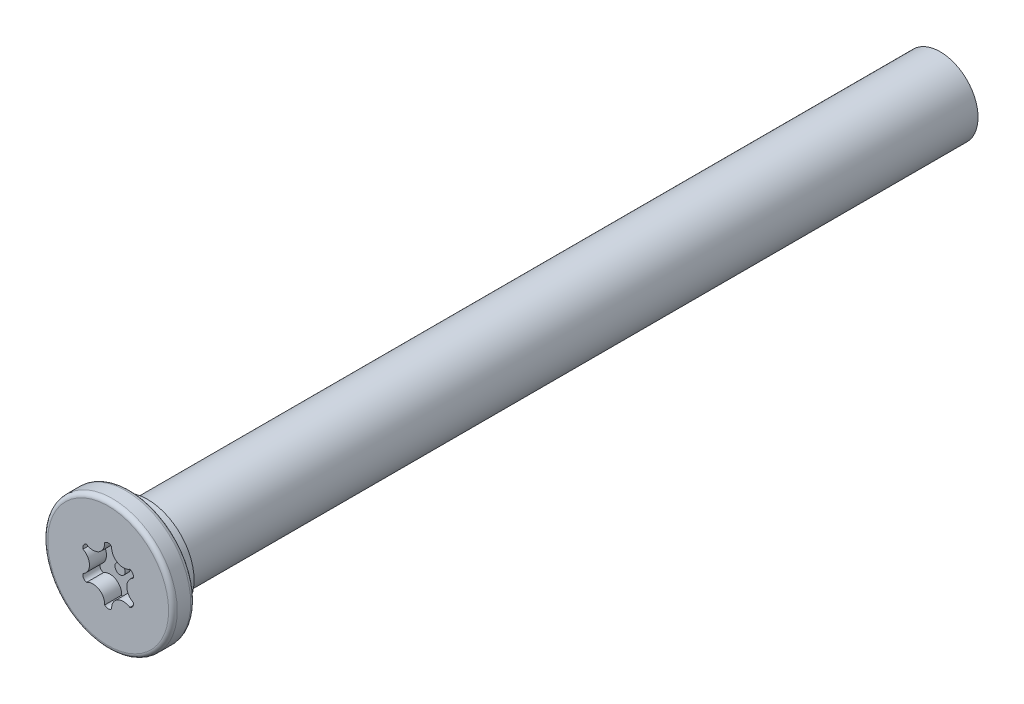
ISO-10303-21;
HEADER;
FILE_DESCRIPTION(('STEP AP214'),'2;1');
FILE_NAME('part.step','',(''),(''),'','','');
FILE_SCHEMA(('AUTOMOTIVE_DESIGN { 1 0 10303 214 1 1 1 1 }'));
ENDSEC;
DATA;
#1=APPLICATION_CONTEXT('core data for automotive mechanical design processes');
#2=APPLICATION_PROTOCOL_DEFINITION('international standard','automotive_design',2000,#1);
#3=PRODUCT_CONTEXT('',#1,'mechanical');
#4=PRODUCT('Part','Part','',(#3));
#5=PRODUCT_RELATED_PRODUCT_CATEGORY('part','',(#4));
#6=PRODUCT_DEFINITION_FORMATION('','',#4);
#7=PRODUCT_DEFINITION_CONTEXT('part definition',#1,'design');
#8=PRODUCT_DEFINITION('design','',#6,#7);
#9=PRODUCT_DEFINITION_SHAPE('','',#8);
#10=(LENGTH_UNIT() NAMED_UNIT(*) SI_UNIT(.MILLI.,.METRE.));
#11=(NAMED_UNIT(*) PLANE_ANGLE_UNIT() SI_UNIT($,.RADIAN.));
#12=(NAMED_UNIT(*) SI_UNIT($,.STERADIAN.) SOLID_ANGLE_UNIT());
#13=UNCERTAINTY_MEASURE_WITH_UNIT(LENGTH_MEASURE(1.E-05),#10,'distance_accuracy_value','');
#14=(GEOMETRIC_REPRESENTATION_CONTEXT(3) GLOBAL_UNCERTAINTY_ASSIGNED_CONTEXT((#13)) GLOBAL_UNIT_ASSIGNED_CONTEXT((#10,
#11,#12)) REPRESENTATION_CONTEXT('',''));
#15=CARTESIAN_POINT('',(0.,0.,0.));
#16=DIRECTION('',(0.,0.,1.));
#17=DIRECTION('',(1.,0.,0.));
#18=AXIS2_PLACEMENT_3D('',#15,#16,#17);
#19=CARTESIAN_POINT('',(0.,0.,0.));
#20=DIRECTION('',(0.,0.,1.));
#21=DIRECTION('',(1.,0.,0.));
#22=AXIS2_PLACEMENT_3D('',#19,#20,#21);
#23=PLANE('',#22);
#24=CARTESIAN_POINT('',(0.,0.,0.));
#25=DIRECTION('',(0.,0.,1.));
#26=DIRECTION('',(1.,0.,0.));
#27=AXIS2_PLACEMENT_3D('',#24,#25,#26);
#28=CIRCLE('',#27,3.55599999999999);
#29=CARTESIAN_POINT('',(3.55599999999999,0.,0.));
#30=VERTEX_POINT('',#29);
#31=EDGE_CURVE('E54',#30,#30,#28,.T.);
#32=ORIENTED_EDGE('',*,*,#31,.T.);
#33=EDGE_LOOP('',(#32));
#34=FACE_BOUND('',#33,.T.);
#35=CARTESIAN_POINT('',(0.893828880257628,1.54815703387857,0.));
#36=DIRECTION('',(0.,0.,1.));
#37=DIRECTION('',(1.,0.,0.));
#38=AXIS2_PLACEMENT_3D('',#35,#36,#37);
#39=CIRCLE('',#38,0.69);
#40=CARTESIAN_POINT('',(0.205060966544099,1.58937306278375,0.));
#41=VERTEX_POINT('',#40);
#42=CARTESIAN_POINT('',(1.27390696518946,0.972274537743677,0.));
#43=VERTEX_POINT('',#42);
#44=EDGE_CURVE('E181',#41,#43,#39,.T.);
#45=ORIENTED_EDGE('',*,*,#44,.T.);
#46=CARTESIAN_POINT('',(1.19884944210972,0.692156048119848,0.));
#47=DIRECTION('',(0.,0.,1.));
#48=DIRECTION('',(1.,0.,0.));
#49=AXIS2_PLACEMENT_3D('',#46,#47,#48);
#50=CIRCLE('',#49,0.29);
#51=CARTESIAN_POINT('',(1.47896793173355,0.617098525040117,0.));
#52=VERTEX_POINT('',#51);
#53=EDGE_CURVE('E61',#43,#52,#50,.F.);
#54=ORIENTED_EDGE('',*,*,#53,.T.);
#55=CARTESIAN_POINT('',(1.78765776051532,0.,0.));
#56=DIRECTION('',(0.,0.,1.));
#57=DIRECTION('',(1.,0.,0.));
#58=AXIS2_PLACEMENT_3D('',#55,#56,#57);
#59=CIRCLE('',#58,0.69);
#60=CARTESIAN_POINT('',(1.47896793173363,-0.617098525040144,0.));
#61=VERTEX_POINT('',#60);
#62=EDGE_CURVE('E111',#52,#61,#59,.T.);
#63=ORIENTED_EDGE('',*,*,#62,.T.);
#64=CARTESIAN_POINT('',(1.1988494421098,-0.692156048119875,0.));
#65=DIRECTION('',(0.,0.,1.));
#66=DIRECTION('',(1.,0.,0.));
#67=AXIS2_PLACEMENT_3D('',#64,#65,#66);
#68=CIRCLE('',#67,0.29);
#69=CARTESIAN_POINT('',(1.27390696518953,-0.972274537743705,0.));
#70=VERTEX_POINT('',#69);
#71=EDGE_CURVE('E216',#61,#70,#68,.F.);
#72=ORIENTED_EDGE('',*,*,#71,.T.);
#73=CARTESIAN_POINT('',(0.893828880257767,-1.54815703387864,0.));
#74=DIRECTION('',(0.,0.,1.));
#75=DIRECTION('',(1.,0.,0.));
#76=AXIS2_PLACEMENT_3D('',#73,#74,#75);
#77=CIRCLE('',#76,0.69);
#78=CARTESIAN_POINT('',(0.205060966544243,-1.5893730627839,0.));
#79=VERTEX_POINT('',#78);
#80=EDGE_CURVE('E160',#70,#79,#77,.T.);
#81=ORIENTED_EDGE('',*,*,#80,.T.);
#82=CARTESIAN_POINT('',(1.43067375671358E-13,-1.3843120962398,0.));
#83=DIRECTION('',(0.,0.,1.));
#84=DIRECTION('',(1.,0.,0.));
#85=AXIS2_PLACEMENT_3D('',#82,#83,#84);
#86=CIRCLE('',#85,0.29);
#87=CARTESIAN_POINT('',(-0.205060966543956,-1.5893730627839,0.));
#88=VERTEX_POINT('',#87);
#89=EDGE_CURVE('E210',#79,#88,#86,.F.);
#90=ORIENTED_EDGE('',*,*,#89,.T.);
#91=CARTESIAN_POINT('',(-0.893828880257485,-1.54815703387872,0.));
#92=DIRECTION('',(0.,0.,1.));
#93=DIRECTION('',(1.,0.,0.));
#94=AXIS2_PLACEMENT_3D('',#91,#92,#93);
#95=CIRCLE('',#94,0.69);
#96=CARTESIAN_POINT('',(-1.27390696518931,-0.97227453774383,0.));
#97=VERTEX_POINT('',#96);
#98=EDGE_CURVE('E206',#88,#97,#95,.T.);
#99=ORIENTED_EDGE('',*,*,#98,.T.);
#100=CARTESIAN_POINT('',(-1.19884944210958,-0.69215604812,0.));
#101=DIRECTION('',(0.,0.,1.));
#102=DIRECTION('',(1.,0.,0.));
#103=AXIS2_PLACEMENT_3D('',#100,#101,#102);
#104=CIRCLE('',#103,0.29);
#105=CARTESIAN_POINT('',(-1.47896793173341,-0.617098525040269,0.));
#106=VERTEX_POINT('',#105);
#107=EDGE_CURVE('E202',#97,#106,#104,.F.);
#108=ORIENTED_EDGE('',*,*,#107,.T.);
#109=CARTESIAN_POINT('',(-1.78765776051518,-1.56674837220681E-13,0.));
#110=DIRECTION('',(0.,0.,1.));
#111=DIRECTION('',(1.,0.,0.));
#112=AXIS2_PLACEMENT_3D('',#109,#110,#111);
#113=CIRCLE('',#112,0.69);
#114=CARTESIAN_POINT('',(-1.47896793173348,0.617098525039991,0.));
#115=VERTEX_POINT('',#114);
#116=EDGE_CURVE('E198',#106,#115,#113,.T.);
#117=ORIENTED_EDGE('',*,*,#116,.T.);
#118=CARTESIAN_POINT('',(-1.19884944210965,0.692156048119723,0.));
#119=DIRECTION('',(0.,0.,1.));
#120=DIRECTION('',(1.,0.,0.));
#121=AXIS2_PLACEMENT_3D('',#118,#119,#120);
#122=CIRCLE('',#121,0.29);
#123=CARTESIAN_POINT('',(-1.27390696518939,0.972274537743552,0.));
#124=VERTEX_POINT('',#123);
#125=EDGE_CURVE('E194',#115,#124,#122,.F.);
#126=ORIENTED_EDGE('',*,*,#125,.T.);
#127=CARTESIAN_POINT('',(-0.893828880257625,1.54815703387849,0.));
#128=DIRECTION('',(0.,0.,1.));
#129=DIRECTION('',(1.,0.,0.));
#130=AXIS2_PLACEMENT_3D('',#127,#128,#129);
#131=CIRCLE('',#130,0.690000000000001);
#132=CARTESIAN_POINT('',(-0.205060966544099,1.58937306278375,0.));
#133=VERTEX_POINT('',#132);
#134=EDGE_CURVE('E190',#124,#133,#131,.T.);
#135=ORIENTED_EDGE('',*,*,#134,.T.);
#136=CARTESIAN_POINT('',(0.,1.38431209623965,0.));
#137=DIRECTION('',(0.,0.,1.));
#138=DIRECTION('',(1.,0.,0.));
#139=AXIS2_PLACEMENT_3D('',#136,#137,#138);
#140=CIRCLE('',#139,0.29);
#141=EDGE_CURVE('E186',#133,#41,#140,.F.);
#142=ORIENTED_EDGE('',*,*,#141,.T.);
#143=EDGE_LOOP('',(#45,#54,#63,#72,#81,#90,#99,#108,#117,#126,#135,#142));
#144=FACE_BOUND('',#143,.T.);
#145=ADVANCED_FACE('F45',(#34,#144),#23,.T.);
#146=CARTESIAN_POINT('',(0.,0.,-1.3));
#147=DIRECTION('',(0.,0.,1.));
#148=DIRECTION('',(1.,0.,0.));
#149=AXIS2_PLACEMENT_3D('',#146,#147,#148);
#150=PLANE('',#149);
#151=CARTESIAN_POINT('',(0.,0.,-1.3));
#152=DIRECTION('',(0.,0.,1.));
#153=DIRECTION('',(1.,0.,0.));
#154=AXIS2_PLACEMENT_3D('',#151,#152,#153);
#155=CIRCLE('',#154,2.738000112);
#156=CARTESIAN_POINT('',(2.738000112,0.,-1.3));
#157=VERTEX_POINT('',#156);
#158=EDGE_CURVE('E11',#157,#157,#155,.F.);
#159=ORIENTED_EDGE('',*,*,#158,.F.);
#160=EDGE_LOOP('',(#159));
#161=FACE_BOUND('',#160,.T.);
#162=CARTESIAN_POINT('',(0.,0.,-1.3));
#163=DIRECTION('',(0.,0.,1.));
#164=DIRECTION('',(1.,0.,0.));
#165=AXIS2_PLACEMENT_3D('',#162,#163,#164);
#166=CIRCLE('',#165,3.55599999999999);
#167=CARTESIAN_POINT('',(3.55599999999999,0.,-1.3));
#168=VERTEX_POINT('',#167);
#169=EDGE_CURVE('E260',#168,#168,#166,.F.);
#170=ORIENTED_EDGE('',*,*,#169,.T.);
#171=EDGE_LOOP('',(#170));
#172=FACE_BOUND('',#171,.T.);
#173=ADVANCED_FACE('F283',(#161,#172),#150,.F.);
#174=CARTESIAN_POINT('',(0.,0.,-1.3));
#175=DIRECTION('',(0.,0.,1.));
#176=DIRECTION('',(1.,0.,0.));
#177=AXIS2_PLACEMENT_3D('',#174,#175,#176);
#178=CYLINDRICAL_SURFACE('',#177,3.80999999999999);
#179=CARTESIAN_POINT('',(0.,0.,-1.046));
#180=DIRECTION('',(0.,0.,1.));
#181=DIRECTION('',(1.,0.,0.));
#182=AXIS2_PLACEMENT_3D('',#179,#180,#181);
#183=CIRCLE('',#182,3.80999999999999);
#184=CARTESIAN_POINT('',(3.80999999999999,0.,-1.046));
#185=VERTEX_POINT('',#184);
#186=EDGE_CURVE('E256',#185,#185,#183,.T.);
#187=ORIENTED_EDGE('',*,*,#186,.T.);
#188=EDGE_LOOP('',(#187));
#189=FACE_BOUND('',#188,.T.);
#190=CARTESIAN_POINT('',(0.,0.,-0.254));
#191=DIRECTION('',(0.,0.,1.));
#192=DIRECTION('',(1.,0.,0.));
#193=AXIS2_PLACEMENT_3D('',#190,#191,#192);
#194=CIRCLE('',#193,3.80999999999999);
#195=CARTESIAN_POINT('',(3.80999999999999,0.,-0.254));
#196=VERTEX_POINT('',#195);
#197=EDGE_CURVE('E225',#196,#196,#194,.F.);
#198=ORIENTED_EDGE('',*,*,#197,.T.);
#199=EDGE_LOOP('',(#198));
#200=FACE_BOUND('',#199,.T.);
#201=ADVANCED_FACE('F289',(#189,#200),#178,.T.);
#202=CARTESIAN_POINT('',(1.19884944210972,0.692156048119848,-1.));
#203=DIRECTION('',(0.,0.,1.));
#204=DIRECTION('',(1.,0.,0.));
#205=AXIS2_PLACEMENT_3D('',#202,#203,#204);
#206=CYLINDRICAL_SURFACE('',#205,0.29);
#207=ORIENTED_EDGE('',*,*,#53,.F.);
#208=DIRECTION('',(0.,0.,1.));
#209=VECTOR('',#208,1.);
#210=CARTESIAN_POINT('',(1.27390696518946,0.972274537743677,-1.));
#211=LINE('',#210,#209);
#212=CARTESIAN_POINT('',(1.27390696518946,0.972274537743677,-1.));
#213=VERTEX_POINT('',#212);
#214=EDGE_CURVE('E178',#213,#43,#211,.T.);
#215=ORIENTED_EDGE('',*,*,#214,.F.);
#216=CARTESIAN_POINT('',(1.19884944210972,0.692156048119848,-1.));
#217=DIRECTION('',(0.,0.,1.));
#218=DIRECTION('',(1.,0.,0.));
#219=AXIS2_PLACEMENT_3D('',#216,#217,#218);
#220=CIRCLE('',#219,0.29);
#221=CARTESIAN_POINT('',(1.47896793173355,0.617098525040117,-1.));
#222=VERTEX_POINT('',#221);
#223=EDGE_CURVE('E221',#213,#222,#220,.F.);
#224=ORIENTED_EDGE('',*,*,#223,.T.);
#225=DIRECTION('',(0.,0.,1.));
#226=VECTOR('',#225,1.);
#227=CARTESIAN_POINT('',(1.47896793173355,0.617098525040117,-1.));
#228=LINE('',#227,#226);
#229=EDGE_CURVE('E222',#222,#52,#228,.T.);
#230=ORIENTED_EDGE('',*,*,#229,.T.);
#231=EDGE_LOOP('',(#207,#215,#224,#230));
#232=FACE_BOUND('',#231,.T.);
#233=ADVANCED_FACE('F294',(#232),#206,.F.);
#234=CARTESIAN_POINT('',(1.78765776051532,0.,-1.));
#235=DIRECTION('',(0.,0.,1.));
#236=DIRECTION('',(1.,0.,0.));
#237=AXIS2_PLACEMENT_3D('',#234,#235,#236);
#238=CYLINDRICAL_SURFACE('',#237,0.69);
#239=ORIENTED_EDGE('',*,*,#62,.F.);
#240=ORIENTED_EDGE('',*,*,#229,.F.);
#241=CARTESIAN_POINT('',(1.78765776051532,0.,-1.));
#242=DIRECTION('',(0.,0.,1.));
#243=DIRECTION('',(1.,0.,0.));
#244=AXIS2_PLACEMENT_3D('',#241,#242,#243);
#245=CIRCLE('',#244,0.69);
#246=CARTESIAN_POINT('',(1.47896793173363,-0.617098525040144,-1.));
#247=VERTEX_POINT('',#246);
#248=EDGE_CURVE('E70',#222,#247,#245,.T.);
#249=ORIENTED_EDGE('',*,*,#248,.T.);
#250=DIRECTION('',(0.,0.,1.));
#251=VECTOR('',#250,1.);
#252=CARTESIAN_POINT('',(1.47896793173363,-0.617098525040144,-1.));
#253=LINE('',#252,#251);
#254=EDGE_CURVE('E151',#247,#61,#253,.T.);
#255=ORIENTED_EDGE('',*,*,#254,.T.);
#256=EDGE_LOOP('',(#239,#240,#249,#255));
#257=FACE_BOUND('',#256,.T.);
#258=ADVANCED_FACE('F301',(#257),#238,.T.);
#259=CARTESIAN_POINT('',(1.1988494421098,-0.692156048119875,-1.));
#260=DIRECTION('',(0.,0.,1.));
#261=DIRECTION('',(1.,0.,0.));
#262=AXIS2_PLACEMENT_3D('',#259,#260,#261);
#263=CYLINDRICAL_SURFACE('',#262,0.29);
#264=ORIENTED_EDGE('',*,*,#71,.F.);
#265=ORIENTED_EDGE('',*,*,#254,.F.);
#266=CARTESIAN_POINT('',(1.1988494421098,-0.692156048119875,-1.));
#267=DIRECTION('',(0.,0.,1.));
#268=DIRECTION('',(1.,0.,0.));
#269=AXIS2_PLACEMENT_3D('',#266,#267,#268);
#270=CIRCLE('',#269,0.29);
#271=CARTESIAN_POINT('',(1.27390696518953,-0.972274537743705,-1.));
#272=VERTEX_POINT('',#271);
#273=EDGE_CURVE('E145',#247,#272,#270,.F.);
#274=ORIENTED_EDGE('',*,*,#273,.T.);
#275=DIRECTION('',(0.,0.,1.));
#276=VECTOR('',#275,1.);
#277=CARTESIAN_POINT('',(1.27390696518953,-0.972274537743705,-1.));
#278=LINE('',#277,#276);
#279=EDGE_CURVE('E149',#272,#70,#278,.T.);
#280=ORIENTED_EDGE('',*,*,#279,.T.);
#281=EDGE_LOOP('',(#264,#265,#274,#280));
#282=FACE_BOUND('',#281,.T.);
#283=ADVANCED_FACE('F148',(#282),#263,.F.);
#284=CARTESIAN_POINT('',(0.893828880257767,-1.54815703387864,-1.));
#285=DIRECTION('',(0.,0.,1.));
#286=DIRECTION('',(1.,0.,0.));
#287=AXIS2_PLACEMENT_3D('',#284,#285,#286);
#288=CYLINDRICAL_SURFACE('',#287,0.69);
#289=ORIENTED_EDGE('',*,*,#80,.F.);
#290=ORIENTED_EDGE('',*,*,#279,.F.);
#291=CARTESIAN_POINT('',(0.893828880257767,-1.54815703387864,-1.));
#292=DIRECTION('',(0.,0.,1.));
#293=DIRECTION('',(1.,0.,0.));
#294=AXIS2_PLACEMENT_3D('',#291,#292,#293);
#295=CIRCLE('',#294,0.69);
#296=CARTESIAN_POINT('',(0.205060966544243,-1.5893730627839,-1.));
#297=VERTEX_POINT('',#296);
#298=EDGE_CURVE('E154',#272,#297,#295,.T.);
#299=ORIENTED_EDGE('',*,*,#298,.T.);
#300=DIRECTION('',(0.,0.,1.));
#301=VECTOR('',#300,1.);
#302=CARTESIAN_POINT('',(0.205060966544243,-1.5893730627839,-1.));
#303=LINE('',#302,#301);
#304=EDGE_CURVE('E163',#297,#79,#303,.T.);
#305=ORIENTED_EDGE('',*,*,#304,.T.);
#306=EDGE_LOOP('',(#289,#290,#299,#305));
#307=FACE_BOUND('',#306,.T.);
#308=ADVANCED_FACE('F157',(#307),#288,.T.);
#309=CARTESIAN_POINT('',(1.43067375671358E-13,-1.3843120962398,-1.));
#310=DIRECTION('',(0.,0.,1.));
#311=DIRECTION('',(1.,0.,0.));
#312=AXIS2_PLACEMENT_3D('',#309,#310,#311);
#313=CYLINDRICAL_SURFACE('',#312,0.29);
#314=ORIENTED_EDGE('',*,*,#89,.F.);
#315=ORIENTED_EDGE('',*,*,#304,.F.);
#316=CARTESIAN_POINT('',(1.43067375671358E-13,-1.3843120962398,-1.));
#317=DIRECTION('',(0.,0.,1.));
#318=DIRECTION('',(1.,0.,0.));
#319=AXIS2_PLACEMENT_3D('',#316,#317,#318);
#320=CIRCLE('',#319,0.29);
#321=CARTESIAN_POINT('',(-0.205060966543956,-1.5893730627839,-1.));
#322=VERTEX_POINT('',#321);
#323=EDGE_CURVE('E168',#297,#322,#320,.F.);
#324=ORIENTED_EDGE('',*,*,#323,.T.);
#325=DIRECTION('',(0.,0.,1.));
#326=VECTOR('',#325,1.);
#327=CARTESIAN_POINT('',(-0.205060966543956,-1.5893730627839,-1.));
#328=LINE('',#327,#326);
#329=EDGE_CURVE('E230',#322,#88,#328,.T.);
#330=ORIENTED_EDGE('',*,*,#329,.T.);
#331=EDGE_LOOP('',(#314,#315,#324,#330));
#332=FACE_BOUND('',#331,.T.);
#333=ADVANCED_FACE('F318',(#332),#313,.F.);
#334=CARTESIAN_POINT('',(-0.893828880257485,-1.54815703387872,-1.));
#335=DIRECTION('',(0.,0.,1.));
#336=DIRECTION('',(1.,0.,0.));
#337=AXIS2_PLACEMENT_3D('',#334,#335,#336);
#338=CYLINDRICAL_SURFACE('',#337,0.69);
#339=ORIENTED_EDGE('',*,*,#98,.F.);
#340=ORIENTED_EDGE('',*,*,#329,.F.);
#341=CARTESIAN_POINT('',(-0.893828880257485,-1.54815703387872,-1.));
#342=DIRECTION('',(0.,0.,1.));
#343=DIRECTION('',(1.,0.,0.));
#344=AXIS2_PLACEMENT_3D('',#341,#342,#343);
#345=CIRCLE('',#344,0.69);
#346=CARTESIAN_POINT('',(-1.27390696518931,-0.97227453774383,-1.));
#347=VERTEX_POINT('',#346);
#348=EDGE_CURVE('E172',#322,#347,#345,.T.);
#349=ORIENTED_EDGE('',*,*,#348,.T.);
#350=DIRECTION('',(0.,0.,1.));
#351=VECTOR('',#350,1.);
#352=CARTESIAN_POINT('',(-1.27390696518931,-0.97227453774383,-1.));
#353=LINE('',#352,#351);
#354=EDGE_CURVE('E233',#347,#97,#353,.T.);
#355=ORIENTED_EDGE('',*,*,#354,.T.);
#356=EDGE_LOOP('',(#339,#340,#349,#355));
#357=FACE_BOUND('',#356,.T.);
#358=ADVANCED_FACE('F321',(#357),#338,.T.);
#359=CARTESIAN_POINT('',(-1.19884944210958,-0.69215604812,-1.));
#360=DIRECTION('',(0.,0.,1.));
#361=DIRECTION('',(1.,0.,0.));
#362=AXIS2_PLACEMENT_3D('',#359,#360,#361);
#363=CYLINDRICAL_SURFACE('',#362,0.29);
#364=ORIENTED_EDGE('',*,*,#107,.F.);
#365=ORIENTED_EDGE('',*,*,#354,.F.);
#366=CARTESIAN_POINT('',(-1.19884944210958,-0.69215604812,-1.));
#367=DIRECTION('',(0.,0.,1.));
#368=DIRECTION('',(1.,0.,0.));
#369=AXIS2_PLACEMENT_3D('',#366,#367,#368);
#370=CIRCLE('',#369,0.29);
#371=CARTESIAN_POINT('',(-1.47896793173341,-0.617098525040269,-1.));
#372=VERTEX_POINT('',#371);
#373=EDGE_CURVE('E374',#347,#372,#370,.F.);
#374=ORIENTED_EDGE('',*,*,#373,.T.);
#375=DIRECTION('',(0.,0.,1.));
#376=VECTOR('',#375,1.);
#377=CARTESIAN_POINT('',(-1.47896793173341,-0.617098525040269,-1.));
#378=LINE('',#377,#376);
#379=EDGE_CURVE('E236',#372,#106,#378,.T.);
#380=ORIENTED_EDGE('',*,*,#379,.T.);
#381=EDGE_LOOP('',(#364,#365,#374,#380));
#382=FACE_BOUND('',#381,.T.);
#383=ADVANCED_FACE('F325',(#382),#363,.F.);
#384=CARTESIAN_POINT('',(-1.78765776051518,-1.56674837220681E-13,-1.));
#385=DIRECTION('',(0.,0.,1.));
#386=DIRECTION('',(1.,0.,0.));
#387=AXIS2_PLACEMENT_3D('',#384,#385,#386);
#388=CYLINDRICAL_SURFACE('',#387,0.69);
#389=ORIENTED_EDGE('',*,*,#116,.F.);
#390=ORIENTED_EDGE('',*,*,#379,.F.);
#391=CARTESIAN_POINT('',(-1.78765776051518,-1.56674837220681E-13,-1.));
#392=DIRECTION('',(0.,0.,1.));
#393=DIRECTION('',(1.,0.,0.));
#394=AXIS2_PLACEMENT_3D('',#391,#392,#393);
#395=CIRCLE('',#394,0.69);
#396=CARTESIAN_POINT('',(-1.47896793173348,0.617098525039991,-1.));
#397=VERTEX_POINT('',#396);
#398=EDGE_CURVE('E371',#372,#397,#395,.T.);
#399=ORIENTED_EDGE('',*,*,#398,.T.);
#400=DIRECTION('',(0.,0.,1.));
#401=VECTOR('',#400,1.);
#402=CARTESIAN_POINT('',(-1.47896793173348,0.617098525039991,-1.));
#403=LINE('',#402,#401);
#404=EDGE_CURVE('E239',#397,#115,#403,.T.);
#405=ORIENTED_EDGE('',*,*,#404,.T.);
#406=EDGE_LOOP('',(#389,#390,#399,#405));
#407=FACE_BOUND('',#406,.T.);
#408=ADVANCED_FACE('F329',(#407),#388,.T.);
#409=CARTESIAN_POINT('',(-1.19884944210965,0.692156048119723,-1.));
#410=DIRECTION('',(0.,0.,1.));
#411=DIRECTION('',(1.,0.,0.));
#412=AXIS2_PLACEMENT_3D('',#409,#410,#411);
#413=CYLINDRICAL_SURFACE('',#412,0.29);
#414=ORIENTED_EDGE('',*,*,#125,.F.);
#415=ORIENTED_EDGE('',*,*,#404,.F.);
#416=CARTESIAN_POINT('',(-1.19884944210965,0.692156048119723,-1.));
#417=DIRECTION('',(0.,0.,1.));
#418=DIRECTION('',(1.,0.,0.));
#419=AXIS2_PLACEMENT_3D('',#416,#417,#418);
#420=CIRCLE('',#419,0.29);
#421=CARTESIAN_POINT('',(-1.27390696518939,0.972274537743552,-1.));
#422=VERTEX_POINT('',#421);
#423=EDGE_CURVE('E364',#397,#422,#420,.F.);
#424=ORIENTED_EDGE('',*,*,#423,.T.);
#425=DIRECTION('',(0.,0.,1.));
#426=VECTOR('',#425,1.);
#427=CARTESIAN_POINT('',(-1.27390696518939,0.972274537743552,-1.));
#428=LINE('',#427,#426);
#429=EDGE_CURVE('E242',#422,#124,#428,.T.);
#430=ORIENTED_EDGE('',*,*,#429,.T.);
#431=EDGE_LOOP('',(#414,#415,#424,#430));
#432=FACE_BOUND('',#431,.T.);
#433=ADVANCED_FACE('F333',(#432),#413,.F.);
#434=CARTESIAN_POINT('',(-0.893828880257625,1.54815703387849,-1.));
#435=DIRECTION('',(0.,0.,1.));
#436=DIRECTION('',(1.,0.,0.));
#437=AXIS2_PLACEMENT_3D('',#434,#435,#436);
#438=CYLINDRICAL_SURFACE('',#437,0.690000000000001);
#439=ORIENTED_EDGE('',*,*,#134,.F.);
#440=ORIENTED_EDGE('',*,*,#429,.F.);
#441=CARTESIAN_POINT('',(-0.893828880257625,1.54815703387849,-1.));
#442=DIRECTION('',(0.,0.,1.));
#443=DIRECTION('',(1.,0.,0.));
#444=AXIS2_PLACEMENT_3D('',#441,#442,#443);
#445=CIRCLE('',#444,0.690000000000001);
#446=CARTESIAN_POINT('',(-0.205060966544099,1.58937306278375,-1.));
#447=VERTEX_POINT('',#446);
#448=EDGE_CURVE('E360',#422,#447,#445,.T.);
#449=ORIENTED_EDGE('',*,*,#448,.T.);
#450=DIRECTION('',(0.,0.,1.));
#451=VECTOR('',#450,1.);
#452=CARTESIAN_POINT('',(-0.205060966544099,1.58937306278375,-1.));
#453=LINE('',#452,#451);
#454=EDGE_CURVE('E245',#447,#133,#453,.T.);
#455=ORIENTED_EDGE('',*,*,#454,.T.);
#456=EDGE_LOOP('',(#439,#440,#449,#455));
#457=FACE_BOUND('',#456,.T.);
#458=ADVANCED_FACE('F337',(#457),#438,.T.);
#459=CARTESIAN_POINT('',(0.,1.38431209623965,-1.));
#460=DIRECTION('',(0.,0.,1.));
#461=DIRECTION('',(1.,0.,0.));
#462=AXIS2_PLACEMENT_3D('',#459,#460,#461);
#463=CYLINDRICAL_SURFACE('',#462,0.29);
#464=ORIENTED_EDGE('',*,*,#141,.F.);
#465=ORIENTED_EDGE('',*,*,#454,.F.);
#466=CARTESIAN_POINT('',(0.,1.38431209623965,-1.));
#467=DIRECTION('',(0.,0.,1.));
#468=DIRECTION('',(1.,0.,0.));
#469=AXIS2_PLACEMENT_3D('',#466,#467,#468);
#470=CIRCLE('',#469,0.29);
#471=CARTESIAN_POINT('',(0.205060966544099,1.58937306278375,-1.));
#472=VERTEX_POINT('',#471);
#473=EDGE_CURVE('E357',#447,#472,#470,.F.);
#474=ORIENTED_EDGE('',*,*,#473,.T.);
#475=DIRECTION('',(0.,0.,1.));
#476=VECTOR('',#475,1.);
#477=CARTESIAN_POINT('',(0.205060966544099,1.58937306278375,-1.));
#478=LINE('',#477,#476);
#479=EDGE_CURVE('E248',#472,#41,#478,.T.);
#480=ORIENTED_EDGE('',*,*,#479,.T.);
#481=EDGE_LOOP('',(#464,#465,#474,#480));
#482=FACE_BOUND('',#481,.T.);
#483=ADVANCED_FACE('F341',(#482),#463,.F.);
#484=CARTESIAN_POINT('',(0.893828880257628,1.54815703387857,-1.));
#485=DIRECTION('',(0.,0.,1.));
#486=DIRECTION('',(1.,0.,0.));
#487=AXIS2_PLACEMENT_3D('',#484,#485,#486);
#488=CYLINDRICAL_SURFACE('',#487,0.69);
#489=ORIENTED_EDGE('',*,*,#44,.F.);
#490=ORIENTED_EDGE('',*,*,#479,.F.);
#491=CARTESIAN_POINT('',(0.893828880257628,1.54815703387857,-1.));
#492=DIRECTION('',(0.,0.,1.));
#493=DIRECTION('',(1.,0.,0.));
#494=AXIS2_PLACEMENT_3D('',#491,#492,#493);
#495=CIRCLE('',#494,0.69);
#496=EDGE_CURVE('E118',#472,#213,#495,.T.);
#497=ORIENTED_EDGE('',*,*,#496,.T.);
#498=ORIENTED_EDGE('',*,*,#214,.T.);
#499=EDGE_LOOP('',(#489,#490,#497,#498));
#500=FACE_BOUND('',#499,.T.);
#501=ADVANCED_FACE('F344',(#500),#488,.T.);
#502=CARTESIAN_POINT('',(0.,0.,-1.));
#503=DIRECTION('',(0.,0.,1.));
#504=DIRECTION('',(1.,0.,0.));
#505=AXIS2_PLACEMENT_3D('',#502,#503,#504);
#506=PLANE('',#505);
#507=CARTESIAN_POINT('',(0.,0.,-1.));
#508=DIRECTION('',(0.,0.,1.));
#509=DIRECTION('',(1.,0.,0.));
#510=AXIS2_PLACEMENT_3D('',#507,#508,#509);
#511=CIRCLE('',#510,0.3);
#512=CARTESIAN_POINT('',(0.3,0.,-1.));
#513=VERTEX_POINT('',#512);
#514=EDGE_CURVE('E396',#513,#513,#511,.T.);
#515=ORIENTED_EDGE('',*,*,#514,.F.);
#516=EDGE_LOOP('',(#515));
#517=FACE_BOUND('',#516,.T.);
#518=ORIENTED_EDGE('',*,*,#223,.F.);
#519=ORIENTED_EDGE('',*,*,#496,.F.);
#520=ORIENTED_EDGE('',*,*,#473,.F.);
#521=ORIENTED_EDGE('',*,*,#448,.F.);
#522=ORIENTED_EDGE('',*,*,#423,.F.);
#523=ORIENTED_EDGE('',*,*,#398,.F.);
#524=ORIENTED_EDGE('',*,*,#373,.F.);
#525=ORIENTED_EDGE('',*,*,#348,.F.);
#526=ORIENTED_EDGE('',*,*,#323,.F.);
#527=ORIENTED_EDGE('',*,*,#298,.F.);
#528=ORIENTED_EDGE('',*,*,#273,.F.);
#529=ORIENTED_EDGE('',*,*,#248,.F.);
#530=EDGE_LOOP('',(#518,#519,#520,#521,#522,#523,#524,#525,#526,#527,#528,#529));
#531=FACE_BOUND('',#530,.T.);
#532=ADVANCED_FACE('F166',(#517,#531),#506,.T.);
#533=CARTESIAN_POINT('',(0.,0.,-1.046));
#534=DIRECTION('',(0.,0.,1.));
#535=DIRECTION('',(1.,0.,0.));
#536=AXIS2_PLACEMENT_3D('',#533,#534,#535);
#537=TOROIDAL_SURFACE('',#536,3.55599999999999,0.254);
#538=ORIENTED_EDGE('',*,*,#169,.F.);
#539=EDGE_LOOP('',(#538));
#540=FACE_BOUND('',#539,.T.);
#541=ORIENTED_EDGE('',*,*,#186,.F.);
#542=EDGE_LOOP('',(#541));
#543=FACE_BOUND('',#542,.T.);
#544=ADVANCED_FACE('F271',(#540,#543),#537,.T.);
#545=CARTESIAN_POINT('',(0.,0.,-0.254));
#546=DIRECTION('',(0.,0.,1.));
#547=DIRECTION('',(1.,0.,0.));
#548=AXIS2_PLACEMENT_3D('',#545,#546,#547);
#549=TOROIDAL_SURFACE('',#548,3.55599999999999,0.254);
#550=ORIENTED_EDGE('',*,*,#197,.F.);
#551=EDGE_LOOP('',(#550));
#552=FACE_BOUND('',#551,.T.);
#553=ORIENTED_EDGE('',*,*,#31,.F.);
#554=EDGE_LOOP('',(#553));
#555=FACE_BOUND('',#554,.T.);
#556=ADVANCED_FACE('F47',(#552,#555),#549,.T.);
#557=CARTESIAN_POINT('',(0.,0.,-2.316));
#558=DIRECTION('',(0.,0.,-1.));
#559=DIRECTION('',(-1.,0.,0.));
#560=AXIS2_PLACEMENT_3D('',#557,#558,#559);
#561=PLANE('',#560);
#562=CARTESIAN_POINT('',(0.,0.,-2.316));
#563=DIRECTION('',(0.,0.,-1.));
#564=DIRECTION('',(-1.,0.,0.));
#565=AXIS2_PLACEMENT_3D('',#562,#563,#564);
#566=CIRCLE('',#565,2.738000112);
#567=CARTESIAN_POINT('',(-2.738000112,0.,-2.316));
#568=VERTEX_POINT('',#567);
#569=EDGE_CURVE('E182',#568,#568,#566,.T.);
#570=ORIENTED_EDGE('',*,*,#569,.T.);
#571=EDGE_LOOP('',(#570));
#572=FACE_BOUND('',#571,.T.);
#573=CARTESIAN_POINT('',(0.,0.,-2.316));
#574=DIRECTION('',(0.,0.,-1.));
#575=DIRECTION('',(-1.,0.,0.));
#576=AXIS2_PLACEMENT_3D('',#573,#574,#575);
#577=CIRCLE('',#576,2.230000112);
#578=CARTESIAN_POINT('',(-2.230000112,0.,-2.316));
#579=VERTEX_POINT('',#578);
#580=EDGE_CURVE('E400',#579,#579,#577,.T.);
#581=ORIENTED_EDGE('',*,*,#580,.F.);
#582=EDGE_LOOP('',(#581));
#583=FACE_BOUND('',#582,.T.);
#584=ADVANCED_FACE('F270',(#572,#583),#561,.T.);
#585=CARTESIAN_POINT('',(0.,0.,-2.316));
#586=DIRECTION('',(0.,0.,1.));
#587=DIRECTION('',(1.,0.,0.));
#588=AXIS2_PLACEMENT_3D('',#585,#586,#587);
#589=CYLINDRICAL_SURFACE('',#588,2.738000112);
#590=ORIENTED_EDGE('',*,*,#569,.F.);
#591=EDGE_LOOP('',(#590));
#592=FACE_BOUND('',#591,.T.);
#593=ORIENTED_EDGE('',*,*,#158,.T.);
#594=EDGE_LOOP('',(#593));
#595=FACE_BOUND('',#594,.T.);
#596=ADVANCED_FACE('F277',(#592,#595),#589,.T.);
#597=CARTESIAN_POINT('',(0.,0.,-0.7));
#598=DIRECTION('',(0.,0.,-1.));
#599=DIRECTION('',(-1.,0.,0.));
#600=AXIS2_PLACEMENT_3D('',#597,#598,#599);
#601=CYLINDRICAL_SURFACE('',#600,0.3);
#602=CARTESIAN_POINT('',(0.,0.,-0.7));
#603=DIRECTION('',(0.,0.,1.));
#604=DIRECTION('',(1.,0.,0.));
#605=AXIS2_PLACEMENT_3D('',#602,#603,#604);
#606=CIRCLE('',#605,0.3);
#607=CARTESIAN_POINT('',(0.3,0.,-0.7));
#608=VERTEX_POINT('',#607);
#609=EDGE_CURVE('E395',#608,#608,#606,.T.);
#610=ORIENTED_EDGE('',*,*,#609,.F.);
#611=EDGE_LOOP('',(#610));
#612=FACE_BOUND('',#611,.T.);
#613=ORIENTED_EDGE('',*,*,#514,.T.);
#614=EDGE_LOOP('',(#613));
#615=FACE_BOUND('',#614,.T.);
#616=ADVANCED_FACE('F424',(#612,#615),#601,.T.);
#617=CARTESIAN_POINT('',(0.,0.,-0.7));
#618=DIRECTION('',(0.,0.,1.));
#619=DIRECTION('',(1.,0.,0.));
#620=AXIS2_PLACEMENT_3D('',#617,#618,#619);
#621=PLANE('',#620);
#622=ORIENTED_EDGE('',*,*,#609,.T.);
#623=EDGE_LOOP('',(#622));
#624=FACE_BOUND('',#623,.T.);
#625=ADVANCED_FACE('F416',(#624),#621,.T.);
#626=CARTESIAN_POINT('',(0.,0.,-48.925));
#627=DIRECTION('',(0.,0.,1.));
#628=DIRECTION('',(1.,0.,0.));
#629=AXIS2_PLACEMENT_3D('',#626,#627,#628);
#630=CYLINDRICAL_SURFACE('',#629,2.230000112);
#631=ORIENTED_EDGE('',*,*,#580,.T.);
#632=EDGE_LOOP('',(#631));
#633=FACE_BOUND('',#632,.T.);
#634=CARTESIAN_POINT('',(0.,0.,-48.925));
#635=DIRECTION('',(0.,0.,-1.));
#636=DIRECTION('',(-1.,0.,0.));
#637=AXIS2_PLACEMENT_3D('',#634,#635,#636);
#638=CIRCLE('',#637,2.230000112);
#639=CARTESIAN_POINT('',(-2.230000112,0.,-48.925));
#640=VERTEX_POINT('',#639);
#641=EDGE_CURVE('E407',#640,#640,#638,.T.);
#642=ORIENTED_EDGE('',*,*,#641,.F.);
#643=EDGE_LOOP('',(#642));
#644=FACE_BOUND('',#643,.T.);
#645=ADVANCED_FACE('F414',(#633,#644),#630,.T.);
#646=CARTESIAN_POINT('',(0.,0.,-48.925));
#647=DIRECTION('',(0.,0.,-1.));
#648=DIRECTION('',(-1.,0.,0.));
#649=AXIS2_PLACEMENT_3D('',#646,#647,#648);
#650=PLANE('',#649);
#651=ORIENTED_EDGE('',*,*,#641,.T.);
#652=EDGE_LOOP('',(#651));
#653=FACE_BOUND('',#652,.T.);
#654=ADVANCED_FACE('F412',(#653),#650,.T.);
#655=CLOSED_SHELL('',(#145,#173,#201,#233,#258,#283,#308,#333,#358,#383,#408,#433,#458,#483,
#501,#532,#544,#556,#584,#596,#616,#625,#645,#654));
#656=MANIFOLD_SOLID_BREP('B2',#655);
#657=ADVANCED_BREP_SHAPE_REPRESENTATION('',(#18,#656),#14);
#658=SHAPE_DEFINITION_REPRESENTATION(#9,#657);
ENDSEC;
END-ISO-10303-21;
